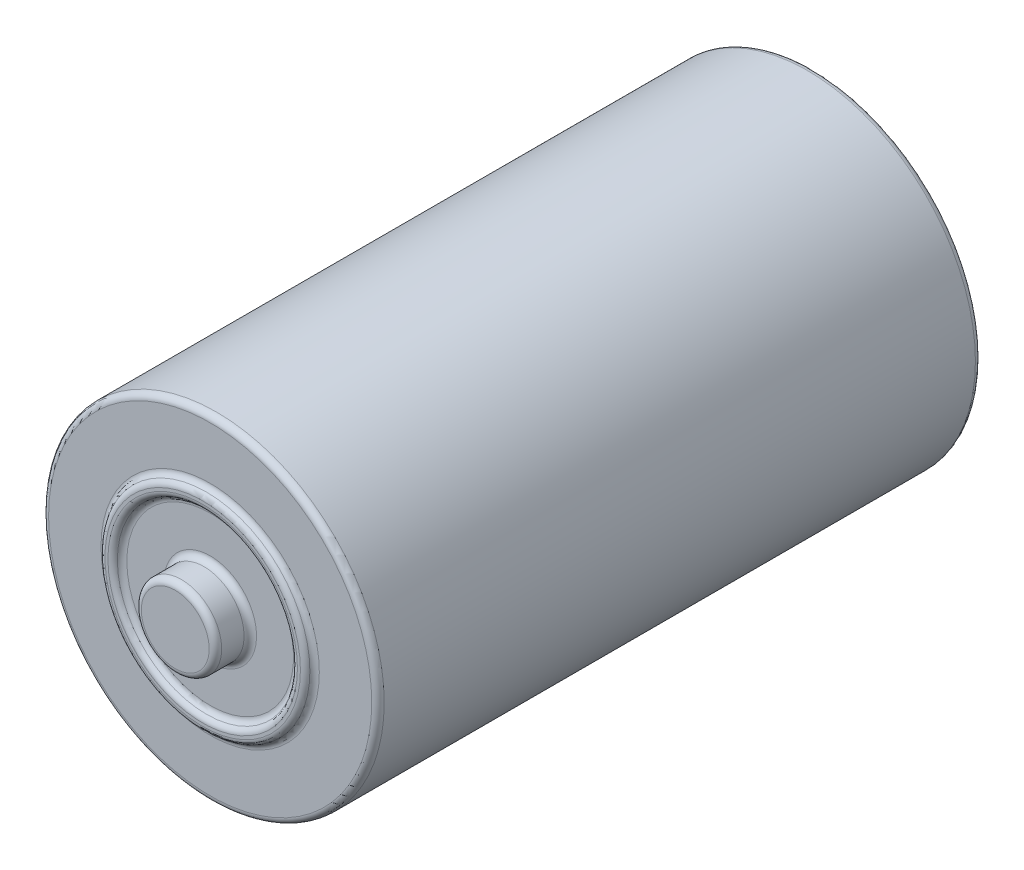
ISO-10303-21;
HEADER;
FILE_DESCRIPTION(('STEP AP214'),'2;1');
FILE_NAME('part.step','',(''),(''),'','','');
FILE_SCHEMA(('AUTOMOTIVE_DESIGN { 1 0 10303 214 1 1 1 1 }'));
ENDSEC;
DATA;
#1=APPLICATION_CONTEXT('core data for automotive mechanical design processes');
#2=APPLICATION_PROTOCOL_DEFINITION('international standard','automotive_design',2000,#1);
#3=PRODUCT_CONTEXT('',#1,'mechanical');
#4=PRODUCT('Part','Part','',(#3));
#5=PRODUCT_RELATED_PRODUCT_CATEGORY('part','',(#4));
#6=PRODUCT_DEFINITION_FORMATION('','',#4);
#7=PRODUCT_DEFINITION_CONTEXT('part definition',#1,'design');
#8=PRODUCT_DEFINITION('design','',#6,#7);
#9=PRODUCT_DEFINITION_SHAPE('','',#8);
#10=(LENGTH_UNIT() NAMED_UNIT(*) SI_UNIT(.MILLI.,.METRE.));
#11=(NAMED_UNIT(*) PLANE_ANGLE_UNIT() SI_UNIT($,.RADIAN.));
#12=(NAMED_UNIT(*) SI_UNIT($,.STERADIAN.) SOLID_ANGLE_UNIT());
#13=UNCERTAINTY_MEASURE_WITH_UNIT(LENGTH_MEASURE(1.E-05),#10,'distance_accuracy_value','');
#14=(GEOMETRIC_REPRESENTATION_CONTEXT(3) GLOBAL_UNCERTAINTY_ASSIGNED_CONTEXT((#13)) GLOBAL_UNIT_ASSIGNED_CONTEXT((#10,
#11,#12)) REPRESENTATION_CONTEXT('',''));
#15=CARTESIAN_POINT('',(0.,0.,0.));
#16=DIRECTION('',(0.,0.,1.));
#17=DIRECTION('',(1.,0.,0.));
#18=AXIS2_PLACEMENT_3D('',#15,#16,#17);
#19=CARTESIAN_POINT('',(0.,0.,-61.4934));
#20=DIRECTION('',(0.,0.,1.));
#21=DIRECTION('',(1.,0.,0.));
#22=AXIS2_PLACEMENT_3D('',#19,#20,#21);
#23=PLANE('',#22);
#24=CARTESIAN_POINT('',(0.,0.,-61.4934));
#25=DIRECTION('',(0.,0.,1.));
#26=DIRECTION('',(1.,0.,0.));
#27=AXIS2_PLACEMENT_3D('',#24,#25,#26);
#28=CIRCLE('',#27,3.91602577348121);
#29=CARTESIAN_POINT('',(3.91602577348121,0.,-61.4934));
#30=VERTEX_POINT('',#29);
#31=EDGE_CURVE('E43',#30,#30,#28,.F.);
#32=ORIENTED_EDGE('',*,*,#31,.T.);
#33=EDGE_LOOP('',(#32));
#34=FACE_BOUND('',#33,.T.);
#35=CARTESIAN_POINT('',(0.,0.,-61.4934));
#36=DIRECTION('',(0.,0.,1.));
#37=DIRECTION('',(1.,0.,0.));
#38=AXIS2_PLACEMENT_3D('',#35,#36,#37);
#39=CIRCLE('',#38,3.81);
#40=CARTESIAN_POINT('',(3.81,0.,-61.4934));
#41=VERTEX_POINT('',#40);
#42=EDGE_CURVE('E102',#41,#41,#39,.F.);
#43=ORIENTED_EDGE('',*,*,#42,.F.);
#44=EDGE_LOOP('',(#43));
#45=FACE_BOUND('',#44,.T.);
#46=ADVANCED_FACE('F28',(#34,#45),#23,.F.);
#47=CARTESIAN_POINT('',(0.,0.,-61.4934));
#48=DIRECTION('',(0.,0.,1.));
#49=DIRECTION('',(1.,0.,0.));
#50=AXIS2_PLACEMENT_3D('',#47,#48,#49);
#51=CIRCLE('',#50,10.0539742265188);
#52=CARTESIAN_POINT('',(10.0539742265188,0.,-61.4934));
#53=VERTEX_POINT('',#52);
#54=EDGE_CURVE('E10',#53,#53,#51,.T.);
#55=ORIENTED_EDGE('',*,*,#54,.T.);
#56=EDGE_LOOP('',(#55));
#57=FACE_BOUND('',#56,.T.);
#58=CARTESIAN_POINT('',(0.,0.,-61.4934));
#59=DIRECTION('',(0.,0.,1.));
#60=DIRECTION('',(1.,0.,0.));
#61=AXIS2_PLACEMENT_3D('',#58,#59,#60);
#62=CIRCLE('',#61,16.4592);
#63=CARTESIAN_POINT('',(16.4592,0.,-61.4934));
#64=VERTEX_POINT('',#63);
#65=EDGE_CURVE('E54',#64,#64,#62,.F.);
#66=ORIENTED_EDGE('',*,*,#65,.T.);
#67=EDGE_LOOP('',(#66));
#68=FACE_BOUND('',#67,.T.);
#69=ADVANCED_FACE('F109',(#57,#68),#23,.F.);
#70=CARTESIAN_POINT('',(0.,17.0942,0.));
#71=DIRECTION('',(0.,0.,-1.));
#72=DIRECTION('',(-1.,0.,0.));
#73=AXIS2_PLACEMENT_3D('',#70,#71,#72);
#74=PLANE('',#73);
#75=CARTESIAN_POINT('',(0.,0.,0.));
#76=DIRECTION('',(0.,0.,-1.));
#77=DIRECTION('',(-1.,0.,0.));
#78=AXIS2_PLACEMENT_3D('',#75,#76,#77);
#79=CIRCLE('',#78,8.48802577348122);
#80=CARTESIAN_POINT('',(-8.48802577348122,0.,0.));
#81=VERTEX_POINT('',#80);
#82=EDGE_CURVE('E69',#81,#81,#79,.F.);
#83=ORIENTED_EDGE('',*,*,#82,.T.);
#84=EDGE_LOOP('',(#83));
#85=FACE_BOUND('',#84,.T.);
#86=CARTESIAN_POINT('',(0.,0.,0.));
#87=DIRECTION('',(0.,0.,-1.));
#88=DIRECTION('',(-1.,0.,0.));
#89=AXIS2_PLACEMENT_3D('',#86,#87,#88);
#90=CIRCLE('',#89,4.7244);
#91=CARTESIAN_POINT('',(-4.7244,0.,0.));
#92=VERTEX_POINT('',#91);
#93=EDGE_CURVE('E81',#92,#92,#90,.T.);
#94=ORIENTED_EDGE('',*,*,#93,.T.);
#95=EDGE_LOOP('',(#94));
#96=FACE_BOUND('',#95,.T.);
#97=ADVANCED_FACE('F30',(#85,#96),#74,.F.);
#98=CARTESIAN_POINT('',(0.,0.,0.));
#99=DIRECTION('',(0.,0.,-1.));
#100=DIRECTION('',(-1.,0.,0.));
#101=AXIS2_PLACEMENT_3D('',#98,#99,#100);
#102=CIRCLE('',#101,11.1207742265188);
#103=CARTESIAN_POINT('',(-11.1207742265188,0.,0.));
#104=VERTEX_POINT('',#103);
#105=EDGE_CURVE('E72',#104,#104,#102,.T.);
#106=ORIENTED_EDGE('',*,*,#105,.T.);
#107=EDGE_LOOP('',(#106));
#108=FACE_BOUND('',#107,.T.);
#109=CARTESIAN_POINT('',(0.,0.,0.));
#110=DIRECTION('',(0.,0.,-1.));
#111=DIRECTION('',(-1.,0.,0.));
#112=AXIS2_PLACEMENT_3D('',#109,#110,#111);
#113=CIRCLE('',#112,16.4592);
#114=CARTESIAN_POINT('',(-16.4592,0.,0.));
#115=VERTEX_POINT('',#114);
#116=EDGE_CURVE('E99',#115,#115,#113,.F.);
#117=ORIENTED_EDGE('',*,*,#116,.T.);
#118=EDGE_LOOP('',(#117));
#119=FACE_BOUND('',#118,.T.);
#120=ADVANCED_FACE('F119',(#108,#119),#74,.F.);
#121=CARTESIAN_POINT('',(0.,0.,20.));
#122=DIRECTION('',(0.,0.,1.));
#123=DIRECTION('',(1.,0.,0.));
#124=AXIS2_PLACEMENT_3D('',#121,#122,#123);
#125=CYLINDRICAL_SURFACE('',#124,17.0942);
#126=CARTESIAN_POINT('',(0.,0.,-60.8584));
#127=DIRECTION('',(0.,0.,1.));
#128=DIRECTION('',(1.,0.,0.));
#129=AXIS2_PLACEMENT_3D('',#126,#127,#128);
#130=CIRCLE('',#129,17.0942);
#131=CARTESIAN_POINT('',(17.0942,0.,-60.8584));
#132=VERTEX_POINT('',#131);
#133=EDGE_CURVE('E57',#132,#132,#130,.T.);
#134=ORIENTED_EDGE('',*,*,#133,.T.);
#135=EDGE_LOOP('',(#134));
#136=FACE_BOUND('',#135,.T.);
#137=CARTESIAN_POINT('',(0.,0.,-0.635000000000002));
#138=DIRECTION('',(0.,0.,-1.));
#139=DIRECTION('',(-1.,0.,0.));
#140=AXIS2_PLACEMENT_3D('',#137,#138,#139);
#141=CIRCLE('',#140,17.0942);
#142=CARTESIAN_POINT('',(-17.0942,0.,-0.635000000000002));
#143=VERTEX_POINT('',#142);
#144=EDGE_CURVE('E96',#143,#143,#141,.T.);
#145=ORIENTED_EDGE('',*,*,#144,.T.);
#146=EDGE_LOOP('',(#145));
#147=FACE_BOUND('',#146,.T.);
#148=ADVANCED_FACE('F115',(#136,#147),#125,.T.);
#149=CARTESIAN_POINT('',(0.,0.,0.762));
#150=DIRECTION('',(0.,0.,1.));
#151=DIRECTION('',(1.,0.,0.));
#152=AXIS2_PLACEMENT_3D('',#149,#150,#151);
#153=PLANE('',#152);
#154=CARTESIAN_POINT('',(0.,0.,0.762));
#155=DIRECTION('',(0.,0.,1.));
#156=DIRECTION('',(1.,0.,0.));
#157=AXIS2_PLACEMENT_3D('',#154,#155,#156);
#158=CIRCLE('',#157,9.9568);
#159=CARTESIAN_POINT('',(9.9568,0.,0.762));
#160=VERTEX_POINT('',#159);
#161=EDGE_CURVE('E90',#160,#160,#158,.T.);
#162=ORIENTED_EDGE('',*,*,#161,.T.);
#163=EDGE_LOOP('',(#162));
#164=FACE_BOUND('',#163,.T.);
#165=CARTESIAN_POINT('',(0.,0.,0.762));
#166=DIRECTION('',(0.,0.,1.));
#167=DIRECTION('',(1.,0.,0.));
#168=AXIS2_PLACEMENT_3D('',#165,#166,#167);
#169=CIRCLE('',#168,9.652);
#170=CARTESIAN_POINT('',(9.652,0.,0.762));
#171=VERTEX_POINT('',#170);
#172=EDGE_CURVE('E93',#171,#171,#169,.F.);
#173=ORIENTED_EDGE('',*,*,#172,.T.);
#174=EDGE_LOOP('',(#173));
#175=FACE_BOUND('',#174,.T.);
#176=ADVANCED_FACE('F118',(#164,#175),#153,.T.);
#177=CARTESIAN_POINT('',(0.,0.,3.556));
#178=DIRECTION('',(0.,0.,-1.));
#179=DIRECTION('',(-1.,0.,0.));
#180=AXIS2_PLACEMENT_3D('',#177,#178,#179);
#181=CYLINDRICAL_SURFACE('',#180,4.0894);
#182=CARTESIAN_POINT('',(0.,0.,0.634999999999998));
#183=DIRECTION('',(0.,0.,-1.));
#184=DIRECTION('',(-1.,0.,0.));
#185=AXIS2_PLACEMENT_3D('',#182,#183,#184);
#186=CIRCLE('',#185,4.0894);
#187=CARTESIAN_POINT('',(-4.0894,0.,0.634999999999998));
#188=VERTEX_POINT('',#187);
#189=EDGE_CURVE('E84',#188,#188,#186,.F.);
#190=ORIENTED_EDGE('',*,*,#189,.T.);
#191=EDGE_LOOP('',(#190));
#192=FACE_BOUND('',#191,.T.);
#193=CARTESIAN_POINT('',(0.,0.,2.921));
#194=DIRECTION('',(0.,0.,1.));
#195=DIRECTION('',(1.,0.,0.));
#196=AXIS2_PLACEMENT_3D('',#193,#194,#195);
#197=CIRCLE('',#196,4.0894);
#198=CARTESIAN_POINT('',(4.0894,0.,2.921));
#199=VERTEX_POINT('',#198);
#200=EDGE_CURVE('E87',#199,#199,#197,.F.);
#201=ORIENTED_EDGE('',*,*,#200,.T.);
#202=EDGE_LOOP('',(#201));
#203=FACE_BOUND('',#202,.T.);
#204=ADVANCED_FACE('F123',(#192,#203),#181,.T.);
#205=CARTESIAN_POINT('',(0.,0.,3.556));
#206=DIRECTION('',(0.,0.,1.));
#207=DIRECTION('',(1.,0.,0.));
#208=AXIS2_PLACEMENT_3D('',#205,#206,#207);
#209=PLANE('',#208);
#210=CARTESIAN_POINT('',(0.,0.,3.556));
#211=DIRECTION('',(0.,0.,1.));
#212=DIRECTION('',(1.,0.,0.));
#213=AXIS2_PLACEMENT_3D('',#210,#211,#212);
#214=CIRCLE('',#213,3.4544);
#215=CARTESIAN_POINT('',(3.4544,0.,3.556));
#216=VERTEX_POINT('',#215);
#217=EDGE_CURVE('E78',#216,#216,#214,.T.);
#218=ORIENTED_EDGE('',*,*,#217,.T.);
#219=EDGE_LOOP('',(#218));
#220=FACE_BOUND('',#219,.T.);
#221=ADVANCED_FACE('F125',(#220),#209,.T.);
#222=CARTESIAN_POINT('',(0.,0.,-62.2554));
#223=DIRECTION('',(0.,0.,-1.));
#224=DIRECTION('',(-1.,0.,0.));
#225=AXIS2_PLACEMENT_3D('',#222,#223,#224);
#226=PLANE('',#225);
#227=CARTESIAN_POINT('',(0.,0.,-62.2554));
#228=DIRECTION('',(0.,0.,-1.));
#229=DIRECTION('',(-1.,0.,0.));
#230=AXIS2_PLACEMENT_3D('',#227,#228,#229);
#231=CIRCLE('',#230,8.89);
#232=CARTESIAN_POINT('',(-8.89,0.,-62.2554));
#233=VERTEX_POINT('',#232);
#234=EDGE_CURVE('E48',#233,#233,#231,.T.);
#235=ORIENTED_EDGE('',*,*,#234,.T.);
#236=EDGE_LOOP('',(#235));
#237=FACE_BOUND('',#236,.T.);
#238=CARTESIAN_POINT('',(0.,0.,-62.2554));
#239=DIRECTION('',(0.,0.,-1.));
#240=DIRECTION('',(-1.,0.,0.));
#241=AXIS2_PLACEMENT_3D('',#238,#239,#240);
#242=CIRCLE('',#241,5.08);
#243=CARTESIAN_POINT('',(-5.08,0.,-62.2554));
#244=VERTEX_POINT('',#243);
#245=EDGE_CURVE('E51',#244,#244,#242,.F.);
#246=ORIENTED_EDGE('',*,*,#245,.T.);
#247=EDGE_LOOP('',(#246));
#248=FACE_BOUND('',#247,.T.);
#249=ADVANCED_FACE('F129',(#237,#248),#226,.T.);
#250=CARTESIAN_POINT('',(0.,0.,-62.2554));
#251=DIRECTION('',(0.,0.,1.));
#252=DIRECTION('',(1.,0.,0.));
#253=AXIS2_PLACEMENT_3D('',#250,#251,#252);
#254=CYLINDRICAL_SURFACE('',#253,3.81);
#255=CARTESIAN_POINT('',(0.,0.,-61.6204));
#256=DIRECTION('',(0.,0.,-1.));
#257=DIRECTION('',(-1.,0.,0.));
#258=AXIS2_PLACEMENT_3D('',#255,#256,#257);
#259=CIRCLE('',#258,3.81);
#260=CARTESIAN_POINT('',(-3.81,0.,-61.6204));
#261=VERTEX_POINT('',#260);
#262=EDGE_CURVE('E60',#261,#261,#259,.F.);
#263=ORIENTED_EDGE('',*,*,#262,.T.);
#264=EDGE_LOOP('',(#263));
#265=FACE_BOUND('',#264,.T.);
#266=ORIENTED_EDGE('',*,*,#42,.T.);
#267=EDGE_LOOP('',(#266));
#268=FACE_BOUND('',#267,.T.);
#269=ADVANCED_FACE('F106',(#265,#268),#254,.T.);
#270=CARTESIAN_POINT('',(0.,0.,-62.2554));
#271=DIRECTION('',(0.,0.,-1.));
#272=DIRECTION('',(-1.,0.,0.));
#273=AXIS2_PLACEMENT_3D('',#270,#271,#272);
#274=PLANE('',#273);
#275=CARTESIAN_POINT('',(0.,0.,-62.2554));
#276=DIRECTION('',(0.,0.,-1.));
#277=DIRECTION('',(-1.,0.,0.));
#278=AXIS2_PLACEMENT_3D('',#275,#276,#277);
#279=CIRCLE('',#278,3.175);
#280=CARTESIAN_POINT('',(-3.175,0.,-62.2554));
#281=VERTEX_POINT('',#280);
#282=EDGE_CURVE('E63',#281,#281,#279,.T.);
#283=ORIENTED_EDGE('',*,*,#282,.T.);
#284=EDGE_LOOP('',(#283));
#285=FACE_BOUND('',#284,.T.);
#286=ADVANCED_FACE('F136',(#285),#274,.T.);
#287=CARTESIAN_POINT('',(0.,0.,-0.635000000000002));
#288=DIRECTION('',(0.,0.,-1.));
#289=DIRECTION('',(-1.,0.,0.));
#290=AXIS2_PLACEMENT_3D('',#287,#288,#289);
#291=TOROIDAL_SURFACE('',#290,16.4592,0.635);
#292=ORIENTED_EDGE('',*,*,#144,.F.);
#293=EDGE_LOOP('',(#292));
#294=FACE_BOUND('',#293,.T.);
#295=ORIENTED_EDGE('',*,*,#116,.F.);
#296=EDGE_LOOP('',(#295));
#297=FACE_BOUND('',#296,.T.);
#298=ADVANCED_FACE('F140',(#294,#297),#291,.T.);
#299=CARTESIAN_POINT('',(0.,0.,0.127));
#300=DIRECTION('',(0.,0.,1.));
#301=DIRECTION('',(1.,0.,0.));
#302=AXIS2_PLACEMENT_3D('',#299,#300,#301);
#303=TOROIDAL_SURFACE('',#302,9.9568,0.635);
#304=CARTESIAN_POINT('',(0.,0.,0.380999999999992));
#305=DIRECTION('',(0.,0.,-1.));
#306=DIRECTION('',(-1.,0.,0.));
#307=AXIS2_PLACEMENT_3D('',#304,#305,#306);
#308=CIRCLE('',#307,10.5387871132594);
#309=CARTESIAN_POINT('',(-10.5387871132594,0.,0.380999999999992));
#310=VERTEX_POINT('',#309);
#311=EDGE_CURVE('E75',#310,#310,#308,.F.);
#312=ORIENTED_EDGE('',*,*,#311,.T.);
#313=EDGE_LOOP('',(#312));
#314=FACE_BOUND('',#313,.T.);
#315=ORIENTED_EDGE('',*,*,#161,.F.);
#316=EDGE_LOOP('',(#315));
#317=FACE_BOUND('',#316,.T.);
#318=ADVANCED_FACE('F146',(#314,#317),#303,.T.);
#319=CARTESIAN_POINT('',(0.,0.,0.127));
#320=DIRECTION('',(0.,0.,1.));
#321=DIRECTION('',(1.,0.,0.));
#322=AXIS2_PLACEMENT_3D('',#319,#320,#321);
#323=TOROIDAL_SURFACE('',#322,9.652,0.635);
#324=CARTESIAN_POINT('',(0.,0.,0.380999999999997));
#325=DIRECTION('',(0.,0.,-1.));
#326=DIRECTION('',(-1.,0.,0.));
#327=AXIS2_PLACEMENT_3D('',#324,#325,#326);
#328=CIRCLE('',#327,9.07001288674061);
#329=CARTESIAN_POINT('',(-9.07001288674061,0.,0.380999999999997));
#330=VERTEX_POINT('',#329);
#331=EDGE_CURVE('E66',#330,#330,#328,.T.);
#332=ORIENTED_EDGE('',*,*,#331,.T.);
#333=EDGE_LOOP('',(#332));
#334=FACE_BOUND('',#333,.T.);
#335=ORIENTED_EDGE('',*,*,#172,.F.);
#336=EDGE_LOOP('',(#335));
#337=FACE_BOUND('',#336,.T.);
#338=ADVANCED_FACE('F150',(#334,#337),#323,.T.);
#339=CARTESIAN_POINT('',(0.,0.,0.634999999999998));
#340=DIRECTION('',(0.,0.,-1.));
#341=DIRECTION('',(-1.,0.,0.));
#342=AXIS2_PLACEMENT_3D('',#339,#340,#341);
#343=TOROIDAL_SURFACE('',#342,4.7244,0.635);
#344=ORIENTED_EDGE('',*,*,#93,.F.);
#345=EDGE_LOOP('',(#344));
#346=FACE_BOUND('',#345,.T.);
#347=ORIENTED_EDGE('',*,*,#189,.F.);
#348=EDGE_LOOP('',(#347));
#349=FACE_BOUND('',#348,.T.);
#350=ADVANCED_FACE('F154',(#346,#349),#343,.F.);
#351=CARTESIAN_POINT('',(0.,0.,2.921));
#352=DIRECTION('',(0.,0.,1.));
#353=DIRECTION('',(1.,0.,0.));
#354=AXIS2_PLACEMENT_3D('',#351,#352,#353);
#355=TOROIDAL_SURFACE('',#354,3.4544,0.635);
#356=ORIENTED_EDGE('',*,*,#200,.F.);
#357=EDGE_LOOP('',(#356));
#358=FACE_BOUND('',#357,.T.);
#359=ORIENTED_EDGE('',*,*,#217,.F.);
#360=EDGE_LOOP('',(#359));
#361=FACE_BOUND('',#360,.T.);
#362=ADVANCED_FACE('F158',(#358,#361),#355,.T.);
#363=CARTESIAN_POINT('',(0.,0.,0.634999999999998));
#364=DIRECTION('',(0.,0.,-1.));
#365=DIRECTION('',(-1.,0.,0.));
#366=AXIS2_PLACEMENT_3D('',#363,#364,#365);
#367=TOROIDAL_SURFACE('',#366,11.1207742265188,0.635);
#368=ORIENTED_EDGE('',*,*,#105,.F.);
#369=EDGE_LOOP('',(#368));
#370=FACE_BOUND('',#369,.T.);
#371=ORIENTED_EDGE('',*,*,#311,.F.);
#372=EDGE_LOOP('',(#371));
#373=FACE_BOUND('',#372,.T.);
#374=ADVANCED_FACE('F162',(#370,#373),#367,.F.);
#375=CARTESIAN_POINT('',(0.,0.,0.634999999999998));
#376=DIRECTION('',(0.,0.,1.));
#377=DIRECTION('',(1.,0.,0.));
#378=AXIS2_PLACEMENT_3D('',#375,#376,#377);
#379=TOROIDAL_SURFACE('',#378,8.48802577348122,0.635);
#380=ORIENTED_EDGE('',*,*,#331,.F.);
#381=EDGE_LOOP('',(#380));
#382=FACE_BOUND('',#381,.T.);
#383=ORIENTED_EDGE('',*,*,#82,.F.);
#384=EDGE_LOOP('',(#383));
#385=FACE_BOUND('',#384,.T.);
#386=ADVANCED_FACE('F166',(#382,#385),#379,.F.);
#387=CARTESIAN_POINT('',(0.,0.,-61.6204));
#388=DIRECTION('',(0.,0.,-1.));
#389=DIRECTION('',(-1.,0.,0.));
#390=AXIS2_PLACEMENT_3D('',#387,#388,#389);
#391=TOROIDAL_SURFACE('',#390,3.175,0.635);
#392=ORIENTED_EDGE('',*,*,#262,.F.);
#393=EDGE_LOOP('',(#392));
#394=FACE_BOUND('',#393,.T.);
#395=ORIENTED_EDGE('',*,*,#282,.F.);
#396=EDGE_LOOP('',(#395));
#397=FACE_BOUND('',#396,.T.);
#398=ADVANCED_FACE('F170',(#394,#397),#391,.T.);
#399=CARTESIAN_POINT('',(0.,0.,-60.8584));
#400=DIRECTION('',(0.,0.,1.));
#401=DIRECTION('',(1.,0.,0.));
#402=AXIS2_PLACEMENT_3D('',#399,#400,#401);
#403=TOROIDAL_SURFACE('',#402,16.4592,0.635);
#404=ORIENTED_EDGE('',*,*,#65,.F.);
#405=EDGE_LOOP('',(#404));
#406=FACE_BOUND('',#405,.T.);
#407=ORIENTED_EDGE('',*,*,#133,.F.);
#408=EDGE_LOOP('',(#407));
#409=FACE_BOUND('',#408,.T.);
#410=ADVANCED_FACE('F174',(#406,#409),#403,.T.);
#411=CARTESIAN_POINT('',(0.,0.,-61.6204));
#412=DIRECTION('',(0.,0.,-1.));
#413=DIRECTION('',(-1.,0.,0.));
#414=AXIS2_PLACEMENT_3D('',#411,#412,#413);
#415=TOROIDAL_SURFACE('',#414,8.89,0.635);
#416=CARTESIAN_POINT('',(0.,0.,-61.8744));
#417=DIRECTION('',(0.,0.,1.));
#418=DIRECTION('',(1.,0.,0.));
#419=AXIS2_PLACEMENT_3D('',#416,#417,#418);
#420=CIRCLE('',#419,9.47198711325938);
#421=CARTESIAN_POINT('',(9.47198711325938,0.,-61.8744));
#422=VERTEX_POINT('',#421);
#423=EDGE_CURVE('E35',#422,#422,#420,.F.);
#424=ORIENTED_EDGE('',*,*,#423,.T.);
#425=EDGE_LOOP('',(#424));
#426=FACE_BOUND('',#425,.T.);
#427=ORIENTED_EDGE('',*,*,#234,.F.);
#428=EDGE_LOOP('',(#427));
#429=FACE_BOUND('',#428,.T.);
#430=ADVANCED_FACE('F178',(#426,#429),#415,.T.);
#431=CARTESIAN_POINT('',(0.,0.,-61.6204));
#432=DIRECTION('',(0.,0.,-1.));
#433=DIRECTION('',(-1.,0.,0.));
#434=AXIS2_PLACEMENT_3D('',#431,#432,#433);
#435=TOROIDAL_SURFACE('',#434,5.08,0.635);
#436=CARTESIAN_POINT('',(0.,0.,-61.8744));
#437=DIRECTION('',(0.,0.,1.));
#438=DIRECTION('',(1.,0.,0.));
#439=AXIS2_PLACEMENT_3D('',#436,#437,#438);
#440=CIRCLE('',#439,4.49801288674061);
#441=CARTESIAN_POINT('',(4.49801288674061,0.,-61.8744));
#442=VERTEX_POINT('',#441);
#443=EDGE_CURVE('E39',#442,#442,#440,.T.);
#444=ORIENTED_EDGE('',*,*,#443,.T.);
#445=EDGE_LOOP('',(#444));
#446=FACE_BOUND('',#445,.T.);
#447=ORIENTED_EDGE('',*,*,#245,.F.);
#448=EDGE_LOOP('',(#447));
#449=FACE_BOUND('',#448,.T.);
#450=ADVANCED_FACE('F182',(#446,#449),#435,.T.);
#451=CARTESIAN_POINT('',(0.,0.,-62.1284));
#452=DIRECTION('',(0.,0.,-1.));
#453=DIRECTION('',(-1.,0.,0.));
#454=AXIS2_PLACEMENT_3D('',#451,#452,#453);
#455=TOROIDAL_SURFACE('',#454,3.91602577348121,0.635);
#456=ORIENTED_EDGE('',*,*,#443,.F.);
#457=EDGE_LOOP('',(#456));
#458=FACE_BOUND('',#457,.T.);
#459=ORIENTED_EDGE('',*,*,#31,.F.);
#460=EDGE_LOOP('',(#459));
#461=FACE_BOUND('',#460,.T.);
#462=ADVANCED_FACE('F185',(#458,#461),#455,.F.);
#463=CARTESIAN_POINT('',(0.,0.,-62.1284));
#464=DIRECTION('',(0.,0.,1.));
#465=DIRECTION('',(1.,0.,0.));
#466=AXIS2_PLACEMENT_3D('',#463,#464,#465);
#467=TOROIDAL_SURFACE('',#466,10.0539742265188,0.635);
#468=ORIENTED_EDGE('',*,*,#54,.F.);
#469=EDGE_LOOP('',(#468));
#470=FACE_BOUND('',#469,.T.);
#471=ORIENTED_EDGE('',*,*,#423,.F.);
#472=EDGE_LOOP('',(#471));
#473=FACE_BOUND('',#472,.T.);
#474=ADVANCED_FACE('F189',(#470,#473),#467,.F.);
#475=CLOSED_SHELL('',(#46,#69,#97,#120,#148,#176,#204,#221,#249,#269,#286,#298,#318,#338,#350,
#362,#374,#386,#398,#410,#430,#450,#462,#474));
#476=MANIFOLD_SOLID_BREP('B2',#475);
#477=ADVANCED_BREP_SHAPE_REPRESENTATION('',(#18,#476),#14);
#478=SHAPE_DEFINITION_REPRESENTATION(#9,#477);
ENDSEC;
END-ISO-10303-21;
